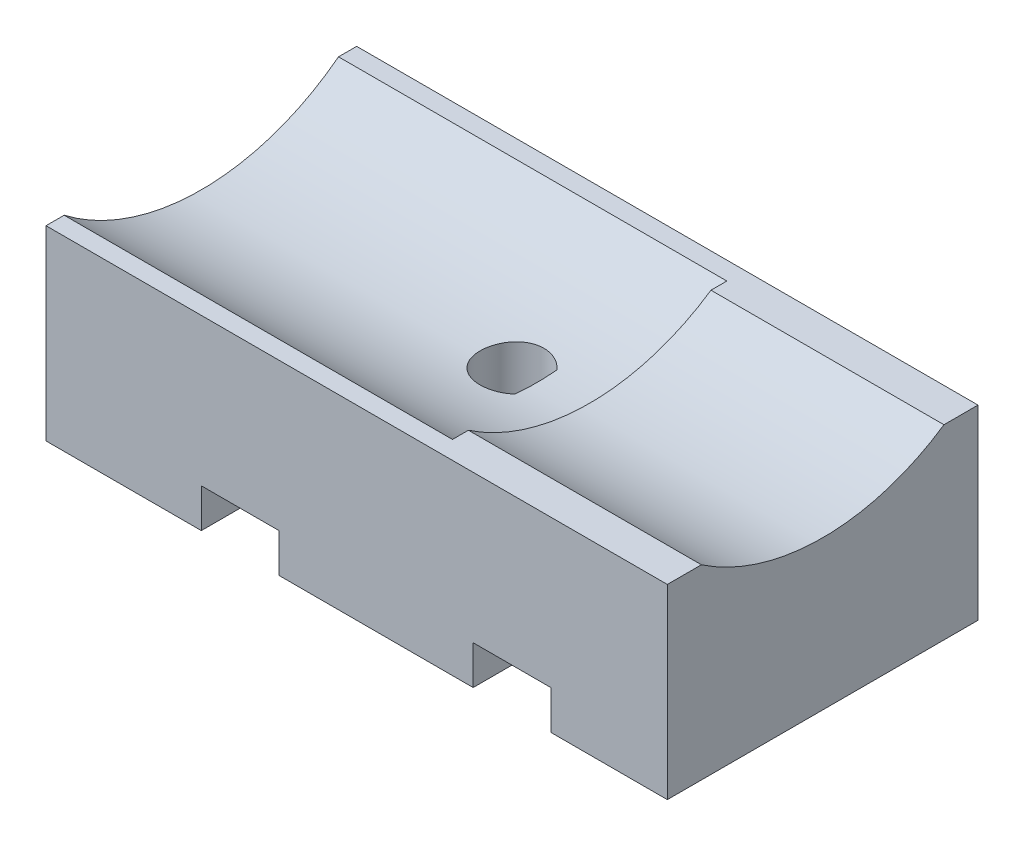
from build123d import *

# Parameters (mm, degrees)
BOSS_EXTRUDE1_DEPTH      = 10
BOSS_EXTRUDE1_DEPTH_BACK = 10
SKETCH2_W                = 40
SKETCH2_H                = 12
CUT_EXTRUDE2_DEPTH       = 26.377155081
CUT_EXTRUDE2_DEPTH_BACK  = 26.377155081
CUT_EXTRUDE3_DEPTH       = 5
CUT_EXTRUDE3_DEPTH_BACK  = 26.377155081
SKETCH4_R                = 14.5
SKETCH5_R                = 13.9
CUT_EXTRUDE4_DEPTH       = 26.377155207
SKETCH6_R                = 33.335556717
SKETCH6_R_2              = 14.5
CUT_EXTRUDE5_DEPTH       = 2.5


with BuildPart() as part:
    # Sketch2 → Boss-Extrude1 (new, two sides: drawn at the far end of the back side and taken through both)
    with BuildSketch(Plane.XY.offset(-BOSS_EXTRUDE1_DEPTH_BACK)):
        with Locations((0, 6)):
            Rectangle(SKETCH2_W, SKETCH2_H)
    extrude(amount=BOSS_EXTRUDE1_DEPTH + BOSS_EXTRUDE1_DEPTH_BACK)

    # Sketch3 → Cut-Extrude2 (cut, two sides: drawn at the far end of the back side and taken through both)
    with BuildSketch(Plane(origin=(0, 0, 0), x_dir=(1, 0, 0), z_dir=(0, 1, 0)).offset(-CUT_EXTRUDE2_DEPTH_BACK)):
        with BuildLine():
            Line((1.55, 1.341640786), (1.55, -1.341640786))
            ThreePointArc((1.55, -1.341640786), (-2.05, 0), (1.55, 1.341640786))
        make_face()
    extrude(amount=CUT_EXTRUDE2_DEPTH + CUT_EXTRUDE2_DEPTH_BACK, mode=Mode.SUBTRACT)

    # Sketch4 → Cut-Extrude3 (cut, two sides: drawn at the far end of the back side and taken through both)
    with BuildSketch(Plane(origin=(0, 0, 0), x_dir=(0, 0, -1), z_dir=(1, 0, 0)).offset(-CUT_EXTRUDE3_DEPTH_BACK)):
        with Locations((0, 23.5)):
            Circle(SKETCH4_R)
    extrude(amount=CUT_EXTRUDE3_DEPTH + CUT_EXTRUDE3_DEPTH_BACK, mode=Mode.SUBTRACT)

    # Sketch5 → Cut-Extrude4 (cut, through all)
    with BuildSketch(Plane(origin=(0, 0, 0), x_dir=(0, 0, -1), z_dir=(1, 0, 0))):
        with Locations((0, 23.5)):
            Circle(SKETCH5_R)
    extrude(amount=CUT_EXTRUDE4_DEPTH, mode=Mode.SUBTRACT)

    # Sketch6 → Cut-Extrude5 (cut, symmetric)
    with BuildSketch(Plane.ZY.offset(7.5)):
        with Locations((0, 13)):
            Circle(SKETCH6_R)
        with Locations((0, 13)):
            Circle(SKETCH6_R_2, mode=Mode.SUBTRACT)
    cut_extrude5 = extrude(amount=CUT_EXTRUDE5_DEPTH, both=True, mode=Mode.SUBTRACT)

    # Mirror1: Cut-Extrude5 across plane
    add(cut_extrude5.mirror(Plane.ZY.offset(-1.25)), mode=Mode.SUBTRACT)


solid = part.part
